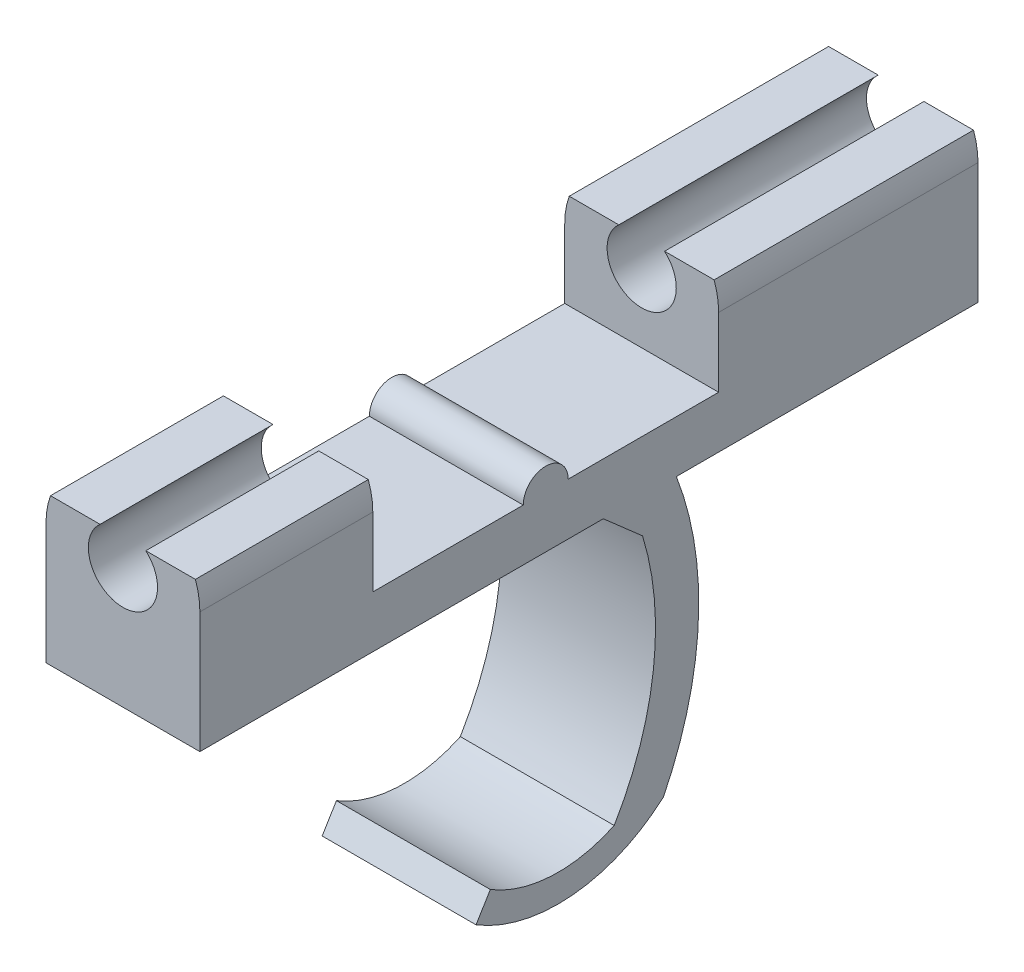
from build123d import *

# Parameters (mm, degrees)
BOSS_EXTRUDE2_DEPTH = 45
SKETCH4_R           = 1.3
BOSS_EXTRUDE3_DEPTH = 8.9
BOSS_EXTRUDE4_DEPTH = 8.9
BOSS_EXTRUDE6_DEPTH = 10
BOSS_EXTRUDE7_DEPTH = 8.9
BOSS_EXTRUDE8_DEPTH = 5
SKETCH11_W          = 8.9
SKETCH11_H          = 45
BOSS_EXTRUDE9_DEPTH = 1.7


with BuildPart() as part:
    # Sketch3 → Boss-Extrude2 (new body)
    with BuildSketch(Plane.XY):
        Polygon((0, 0), (-4.45, 0), (-4.45, 1.3), (4.45, 1.3), (4.45, 0), align=None)
    extrude(amount=BOSS_EXTRUDE2_DEPTH)

    # Sketch4 → Boss-Extrude3 (add)
    with BuildSketch(Plane(origin=(4.45, 0, 0), x_dir=(0, 0, -1), z_dir=(1, 0, 0))):
        with Locations((-25, 1.3)):
            Circle(SKETCH4_R)
    extrude(amount=-BOSS_EXTRUDE3_DEPTH)

    # Sketch5 → Boss-Extrude4 (add)
    with BuildSketch(Plane(origin=(4.45, 0, 0), x_dir=(0, 0, -1), z_dir=(1, 0, 0))):
        with BuildLine():
            ThreePointArc((-21.03821418, 0), (-20.109842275, -1.796548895), (-19.401369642, -3.690626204))
            ThreePointArc((-19.401369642, -3.690626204), (-18.838891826, -6.161646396), (-18.65, -8.68882703))
            ThreePointArc((-18.65, -8.68882703), (-19.257923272, -13.194359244), (-21.03821418, -17.37765406))
            Line((-21.03821418, -17.37765406), (-18.192787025, -17.37765406))
            ThreePointArc((-18.192787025, -17.37765406), (-16.667565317, -13.151693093), (-16.15, -8.68882703))
            ThreePointArc((-16.15, -8.68882703), (-16.667565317, -4.225960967), (-18.192787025, 0))
            Line((-18.192787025, 0), (-21.03821418, 0))
        make_face()
        with BuildLine():
            Line((-23.60777248, 0), (-19.401369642, -3.690626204))
            ThreePointArc((-19.401369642, -3.690626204), (-20.109842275, -1.796548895), (-21.03821418, 0))
            Line((-21.03821418, 0), (-23.60777248, 0))
        make_face()
    extrude(amount=-BOSS_EXTRUDE4_DEPTH)

    # Sketch7 → Boss-Extrude6 (add)
    with BuildSketch(Plane.XY.offset(45)):
        with BuildLine():
            Line((-4.45, 0.85), (4.45, 0.85))
            Line((4.45, 0.85), (4.45, 5.3))
            ThreePointArc((4.45, 5.3), (4.384409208, 6.061220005), (4.189570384, 6.8))
            Line((4.189570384, 6.8), (1.322875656, 6.8))
            ThreePointArc((1.322875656, 6.8), (0, 3.3), (-1.322875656, 6.8))
            Line((-1.322875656, 6.8), (-4.189570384, 6.8))
            ThreePointArc((-4.189570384, 6.8), (-4.384409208, 6.061220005), (-4.45, 5.3))
            Line((-4.45, 5.3), (-4.45, 0.85))
        make_face()
    boss_extrude6 = extrude(amount=-BOSS_EXTRUDE6_DEPTH)

    # Mirror1: Boss-Extrude6 across plane
    add(boss_extrude6.mirror(Plane.XY.offset(25)))

    # Sketch9 → Boss-Extrude7 (add)
    with BuildSketch(Plane(origin=(4.45, 0, 0), x_dir=(0, 0, -1), z_dir=(1, 0, 0))):
        with BuildLine():
            ThreePointArc((-21.03821418, -17.37765406), (-24.66806915, -18.095561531), (-28.203069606, -17.002396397))
            Line((-28.203069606, -17.002396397), (-29.029927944, -18.358639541))
            ThreePointArc((-29.029927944, -18.358639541), (-23.449419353, -19.657109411), (-18.192787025, -17.37765406))
            Line((-18.192787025, -17.37765406), (-21.03821418, -17.37765406))
        make_face()
    extrude(amount=-BOSS_EXTRUDE7_DEPTH)

    # Sketch10 → Boss-Extrude8 (add)
    with BuildSketch(Plane(origin=(0, 0, 5), x_dir=(-1, 0, 0), z_dir=(0, 0, -1))):
        with BuildLine():
            Line((-4.45, 1.3), (4.45, 1.3))
            Line((4.45, 1.3), (4.45, 5.3))
            ThreePointArc((4.45, 5.3), (4.384409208, 6.061220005), (4.189570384, 6.8))
            Line((4.189570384, 6.8), (1.322875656, 6.8))
            ThreePointArc((1.322875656, 6.8), (0, 3.3), (-1.322875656, 6.8))
            Line((-1.322875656, 6.8), (-4.189570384, 6.8))
            ThreePointArc((-4.189570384, 6.8), (-4.384409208, 6.061220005), (-4.45, 5.3))
            Line((-4.45, 5.3), (-4.45, 1.3))
        make_face()
    extrude(amount=BOSS_EXTRUDE8_DEPTH)

    # Sketch11 → Boss-Extrude9 (add)
    with BuildSketch(Plane.XZ):
        with Locations((0, 22.5)):
            Rectangle(SKETCH11_W, SKETCH11_H)
    extrude(amount=BOSS_EXTRUDE9_DEPTH)


solid = part.part
